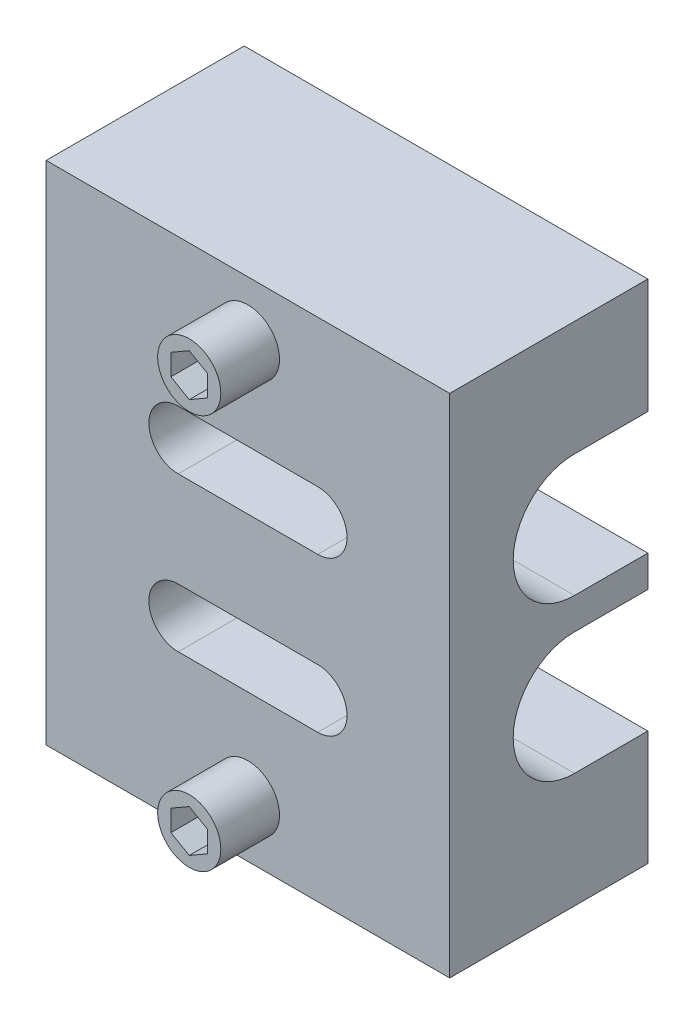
ISO-10303-21;
HEADER;
FILE_DESCRIPTION(('STEP AP214'),'2;1');
FILE_NAME('part.step','',(''),(''),'','','');
FILE_SCHEMA(('AUTOMOTIVE_DESIGN { 1 0 10303 214 1 1 1 1 }'));
ENDSEC;
DATA;
#1=APPLICATION_CONTEXT('core data for automotive mechanical design processes');
#2=APPLICATION_PROTOCOL_DEFINITION('international standard','automotive_design',2000,#1);
#3=PRODUCT_CONTEXT('',#1,'mechanical');
#4=PRODUCT('Part','Part','',(#3));
#5=PRODUCT_RELATED_PRODUCT_CATEGORY('part','',(#4));
#6=PRODUCT_DEFINITION_FORMATION('','',#4);
#7=PRODUCT_DEFINITION_CONTEXT('part definition',#1,'design');
#8=PRODUCT_DEFINITION('design','',#6,#7);
#9=PRODUCT_DEFINITION_SHAPE('','',#8);
#10=(LENGTH_UNIT() NAMED_UNIT(*) SI_UNIT(.MILLI.,.METRE.));
#11=(NAMED_UNIT(*) PLANE_ANGLE_UNIT() SI_UNIT($,.RADIAN.));
#12=(NAMED_UNIT(*) SI_UNIT($,.STERADIAN.) SOLID_ANGLE_UNIT());
#13=UNCERTAINTY_MEASURE_WITH_UNIT(LENGTH_MEASURE(1.E-05),#10,'distance_accuracy_value','');
#14=(GEOMETRIC_REPRESENTATION_CONTEXT(3) GLOBAL_UNCERTAINTY_ASSIGNED_CONTEXT((#13)) GLOBAL_UNIT_ASSIGNED_CONTEXT((#10,
#11,#12)) REPRESENTATION_CONTEXT('',''));
#15=CARTESIAN_POINT('',(0.,0.,0.));
#16=DIRECTION('',(0.,0.,1.));
#17=DIRECTION('',(1.,0.,0.));
#18=AXIS2_PLACEMENT_3D('',#15,#16,#17);
#19=CARTESIAN_POINT('',(-6.985,-8.763,0.));
#20=DIRECTION('',(0.,0.,1.));
#21=DIRECTION('',(1.,0.,0.));
#22=AXIS2_PLACEMENT_3D('',#19,#20,#21);
#23=PLANE('',#22);
#24=DIRECTION('',(0.,1.,0.));
#25=VECTOR('',#24,1.);
#26=CARTESIAN_POINT('',(6.985,-8.763,0.));
#27=LINE('',#26,#25);
#28=CARTESIAN_POINT('',(6.985,-0.546100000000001,0.));
#29=VERTEX_POINT('',#28);
#30=CARTESIAN_POINT('',(6.985,0.546100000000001,0.));
#31=VERTEX_POINT('',#30);
#32=EDGE_CURVE('E342',#29,#31,#27,.T.);
#33=ORIENTED_EDGE('',*,*,#32,.F.);
#34=DIRECTION('',(1.,0.,0.));
#35=VECTOR('',#34,1.);
#36=CARTESIAN_POINT('',(-6.985,-0.546100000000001,0.));
#37=LINE('',#36,#35);
#38=CARTESIAN_POINT('',(-6.985,-0.546100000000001,0.));
#39=VERTEX_POINT('',#38);
#40=EDGE_CURVE('E270',#39,#29,#37,.T.);
#41=ORIENTED_EDGE('',*,*,#40,.F.);
#42=DIRECTION('',(0.,-1.,0.));
#43=VECTOR('',#42,1.);
#44=CARTESIAN_POINT('',(-6.985,8.763,0.));
#45=LINE('',#44,#43);
#46=CARTESIAN_POINT('',(-6.985,0.546100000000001,0.));
#47=VERTEX_POINT('',#46);
#48=EDGE_CURVE('E429',#47,#39,#45,.T.);
#49=ORIENTED_EDGE('',*,*,#48,.F.);
#50=DIRECTION('',(1.,0.,0.));
#51=VECTOR('',#50,1.);
#52=CARTESIAN_POINT('',(-6.985,0.546100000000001,0.));
#53=LINE('',#52,#51);
#54=EDGE_CURVE('E344',#47,#31,#53,.T.);
#55=ORIENTED_EDGE('',*,*,#54,.T.);
#56=EDGE_LOOP('',(#33,#41,#49,#55));
#57=FACE_BOUND('',#56,.T.);
#58=ADVANCED_FACE('F33',(#57),#23,.F.);
#59=CARTESIAN_POINT('',(6.985,4.7879,0.));
#60=VERTEX_POINT('',#59);
#61=CARTESIAN_POINT('',(6.985,8.763,0.));
#62=VERTEX_POINT('',#61);
#63=EDGE_CURVE('E349',#60,#62,#27,.T.);
#64=ORIENTED_EDGE('',*,*,#63,.F.);
#65=DIRECTION('',(1.,0.,0.));
#66=VECTOR('',#65,1.);
#67=CARTESIAN_POINT('',(-6.985,4.7879,0.));
#68=LINE('',#67,#66);
#69=CARTESIAN_POINT('',(-6.985,4.7879,0.));
#70=VERTEX_POINT('',#69);
#71=EDGE_CURVE('E445',#70,#60,#68,.T.);
#72=ORIENTED_EDGE('',*,*,#71,.F.);
#73=CARTESIAN_POINT('',(-6.985,8.763,0.));
#74=VERTEX_POINT('',#73);
#75=EDGE_CURVE('E427',#74,#70,#45,.T.);
#76=ORIENTED_EDGE('',*,*,#75,.F.);
#77=DIRECTION('',(-1.,0.,0.));
#78=VECTOR('',#77,1.);
#79=CARTESIAN_POINT('',(6.985,8.763,0.));
#80=LINE('',#79,#78);
#81=EDGE_CURVE('E352',#62,#74,#80,.T.);
#82=ORIENTED_EDGE('',*,*,#81,.F.);
#83=EDGE_LOOP('',(#64,#72,#76,#82));
#84=FACE_BOUND('',#83,.T.);
#85=ADVANCED_FACE('F315',(#84),#23,.F.);
#86=CARTESIAN_POINT('',(-6.985,-8.763,6.858));
#87=DIRECTION('',(0.,0.,1.));
#88=DIRECTION('',(1.,0.,0.));
#89=AXIS2_PLACEMENT_3D('',#86,#87,#88);
#90=PLANE('',#89);
#91=CARTESIAN_POINT('',(0.,6.8326,6.858));
#92=DIRECTION('',(0.,0.,1.));
#93=DIRECTION('',(1.,0.,0.));
#94=AXIS2_PLACEMENT_3D('',#91,#92,#93);
#95=CIRCLE('',#94,1.0922);
#96=CARTESIAN_POINT('',(1.0922,6.8326,6.858));
#97=VERTEX_POINT('',#96);
#98=EDGE_CURVE('E922',#97,#97,#95,.T.);
#99=ORIENTED_EDGE('',*,*,#98,.F.);
#100=EDGE_LOOP('',(#99));
#101=FACE_BOUND('',#100,.T.);
#102=CARTESIAN_POINT('',(-2.413,2.667,6.858));
#103=DIRECTION('',(0.,0.,1.));
#104=DIRECTION('',(1.,0.,0.));
#105=AXIS2_PLACEMENT_3D('',#102,#103,#104);
#106=CIRCLE('',#105,1.016);
#107=CARTESIAN_POINT('',(-2.413,3.683,6.858));
#108=VERTEX_POINT('',#107);
#109=CARTESIAN_POINT('',(-2.413,1.651,6.858));
#110=VERTEX_POINT('',#109);
#111=EDGE_CURVE('E388',#108,#110,#106,.T.);
#112=ORIENTED_EDGE('',*,*,#111,.F.);
#113=DIRECTION('',(-1.,0.,0.));
#114=VECTOR('',#113,1.);
#115=CARTESIAN_POINT('',(2.413,3.683,6.858));
#116=LINE('',#115,#114);
#117=CARTESIAN_POINT('',(2.413,3.683,6.858));
#118=VERTEX_POINT('',#117);
#119=EDGE_CURVE('E390',#118,#108,#116,.T.);
#120=ORIENTED_EDGE('',*,*,#119,.F.);
#121=CARTESIAN_POINT('',(2.413,2.667,6.858));
#122=DIRECTION('',(0.,0.,1.));
#123=DIRECTION('',(1.,0.,0.));
#124=AXIS2_PLACEMENT_3D('',#121,#122,#123);
#125=CIRCLE('',#124,1.016);
#126=CARTESIAN_POINT('',(2.413,1.651,6.858));
#127=VERTEX_POINT('',#126);
#128=EDGE_CURVE('E395',#127,#118,#125,.T.);
#129=ORIENTED_EDGE('',*,*,#128,.F.);
#130=DIRECTION('',(1.,0.,0.));
#131=VECTOR('',#130,1.);
#132=CARTESIAN_POINT('',(-2.413,1.651,6.858));
#133=LINE('',#132,#131);
#134=EDGE_CURVE('E931',#110,#127,#133,.T.);
#135=ORIENTED_EDGE('',*,*,#134,.F.);
#136=EDGE_LOOP('',(#112,#120,#129,#135));
#137=FACE_BOUND('',#136,.T.);
#138=CARTESIAN_POINT('',(-2.413,-2.667,6.858));
#139=DIRECTION('',(0.,0.,1.));
#140=DIRECTION('',(1.,0.,0.));
#141=AXIS2_PLACEMENT_3D('',#138,#139,#140);
#142=CIRCLE('',#141,1.016);
#143=CARTESIAN_POINT('',(-2.413,-1.651,6.858));
#144=VERTEX_POINT('',#143);
#145=CARTESIAN_POINT('',(-2.413,-3.683,6.858));
#146=VERTEX_POINT('',#145);
#147=EDGE_CURVE('E399',#144,#146,#142,.T.);
#148=ORIENTED_EDGE('',*,*,#147,.F.);
#149=DIRECTION('',(-1.,0.,0.));
#150=VECTOR('',#149,1.);
#151=CARTESIAN_POINT('',(2.413,-1.651,6.858));
#152=LINE('',#151,#150);
#153=CARTESIAN_POINT('',(2.413,-1.651,6.858));
#154=VERTEX_POINT('',#153);
#155=EDGE_CURVE('E409',#154,#144,#152,.T.);
#156=ORIENTED_EDGE('',*,*,#155,.F.);
#157=CARTESIAN_POINT('',(2.413,-2.667,6.858));
#158=DIRECTION('',(0.,0.,1.));
#159=DIRECTION('',(1.,0.,0.));
#160=AXIS2_PLACEMENT_3D('',#157,#158,#159);
#161=CIRCLE('',#160,1.016);
#162=CARTESIAN_POINT('',(2.413,-3.683,6.858));
#163=VERTEX_POINT('',#162);
#164=EDGE_CURVE('E406',#163,#154,#161,.T.);
#165=ORIENTED_EDGE('',*,*,#164,.F.);
#166=DIRECTION('',(1.,0.,0.));
#167=VECTOR('',#166,1.);
#168=CARTESIAN_POINT('',(-2.413,-3.683,6.858));
#169=LINE('',#168,#167);
#170=EDGE_CURVE('E402',#146,#163,#169,.T.);
#171=ORIENTED_EDGE('',*,*,#170,.F.);
#172=EDGE_LOOP('',(#148,#156,#165,#171));
#173=FACE_BOUND('',#172,.T.);
#174=DIRECTION('',(0.,-1.,0.));
#175=VECTOR('',#174,1.);
#176=CARTESIAN_POINT('',(-6.985,8.763,6.858));
#177=LINE('',#176,#175);
#178=CARTESIAN_POINT('',(-6.985,8.763,6.858));
#179=VERTEX_POINT('',#178);
#180=CARTESIAN_POINT('',(-6.985,-8.763,6.858));
#181=VERTEX_POINT('',#180);
#182=EDGE_CURVE('E358',#179,#181,#177,.T.);
#183=ORIENTED_EDGE('',*,*,#182,.T.);
#184=DIRECTION('',(1.,0.,0.));
#185=VECTOR('',#184,1.);
#186=CARTESIAN_POINT('',(-6.985,-8.763,6.858));
#187=LINE('',#186,#185);
#188=CARTESIAN_POINT('',(6.985,-8.763,6.858));
#189=VERTEX_POINT('',#188);
#190=EDGE_CURVE('E423',#181,#189,#187,.T.);
#191=ORIENTED_EDGE('',*,*,#190,.T.);
#192=DIRECTION('',(0.,1.,0.));
#193=VECTOR('',#192,1.);
#194=CARTESIAN_POINT('',(6.985,-8.763,6.858));
#195=LINE('',#194,#193);
#196=CARTESIAN_POINT('',(6.985,8.763,6.858));
#197=VERTEX_POINT('',#196);
#198=EDGE_CURVE('E425',#189,#197,#195,.T.);
#199=ORIENTED_EDGE('',*,*,#198,.T.);
#200=DIRECTION('',(-1.,0.,0.));
#201=VECTOR('',#200,1.);
#202=CARTESIAN_POINT('',(6.985,8.763,6.858));
#203=LINE('',#202,#201);
#204=EDGE_CURVE('E363',#197,#179,#203,.T.);
#205=ORIENTED_EDGE('',*,*,#204,.T.);
#206=EDGE_LOOP('',(#183,#191,#199,#205));
#207=FACE_BOUND('',#206,.T.);
#208=CARTESIAN_POINT('',(0.,-6.8326,6.858));
#209=DIRECTION('',(0.,0.,1.));
#210=DIRECTION('',(1.,0.,0.));
#211=AXIS2_PLACEMENT_3D('',#208,#209,#210);
#212=CIRCLE('',#211,1.0922);
#213=CARTESIAN_POINT('',(1.0922,-6.8326,6.858));
#214=VERTEX_POINT('',#213);
#215=EDGE_CURVE('E908',#214,#214,#212,.T.);
#216=ORIENTED_EDGE('',*,*,#215,.F.);
#217=EDGE_LOOP('',(#216));
#218=FACE_BOUND('',#217,.T.);
#219=ADVANCED_FACE('F312',(#101,#137,#173,#207,#218),#90,.T.);
#220=CARTESIAN_POINT('',(-6.985,8.763,6.858));
#221=DIRECTION('',(1.,0.,0.));
#222=DIRECTION('',(0.,1.,0.));
#223=AXIS2_PLACEMENT_3D('',#220,#221,#222);
#224=PLANE('',#223);
#225=ORIENTED_EDGE('',*,*,#48,.T.);
#226=DIRECTION('',(0.,0.,1.));
#227=VECTOR('',#226,1.);
#228=CARTESIAN_POINT('',(-6.985,-0.546100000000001,0.));
#229=LINE('',#228,#227);
#230=CARTESIAN_POINT('',(-6.985,-0.546100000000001,2.54));
#231=VERTEX_POINT('',#230);
#232=EDGE_CURVE('E250',#39,#231,#229,.T.);
#233=ORIENTED_EDGE('',*,*,#232,.T.);
#234=CARTESIAN_POINT('',(-6.985,-2.667,2.54));
#235=DIRECTION('',(1.,0.,0.));
#236=DIRECTION('',(0.,0.,-1.));
#237=AXIS2_PLACEMENT_3D('',#234,#235,#236);
#238=CIRCLE('',#237,2.1209);
#239=CARTESIAN_POINT('',(-6.985,-4.7879,2.54));
#240=VERTEX_POINT('',#239);
#241=EDGE_CURVE('E245',#231,#240,#238,.T.);
#242=ORIENTED_EDGE('',*,*,#241,.T.);
#243=DIRECTION('',(0.,0.,-1.));
#244=VECTOR('',#243,1.);
#245=CARTESIAN_POINT('',(-6.985,-4.7879,2.54));
#246=LINE('',#245,#244);
#247=CARTESIAN_POINT('',(-6.985,-4.7879,0.));
#248=VERTEX_POINT('',#247);
#249=EDGE_CURVE('E253',#240,#248,#246,.T.);
#250=ORIENTED_EDGE('',*,*,#249,.T.);
#251=CARTESIAN_POINT('',(-6.985,-8.763,0.));
#252=VERTEX_POINT('',#251);
#253=EDGE_CURVE('E415',#248,#252,#45,.T.);
#254=ORIENTED_EDGE('',*,*,#253,.T.);
#255=DIRECTION('',(0.,0.,-1.));
#256=VECTOR('',#255,1.);
#257=CARTESIAN_POINT('',(-6.985,-8.763,6.858));
#258=LINE('',#257,#256);
#259=EDGE_CURVE('E369',#181,#252,#258,.T.);
#260=ORIENTED_EDGE('',*,*,#259,.F.);
#261=ORIENTED_EDGE('',*,*,#182,.F.);
#262=DIRECTION('',(0.,0.,-1.));
#263=VECTOR('',#262,1.);
#264=CARTESIAN_POINT('',(-6.985,8.763,6.858));
#265=LINE('',#264,#263);
#266=EDGE_CURVE('E359',#179,#74,#265,.T.);
#267=ORIENTED_EDGE('',*,*,#266,.T.);
#268=ORIENTED_EDGE('',*,*,#75,.T.);
#269=DIRECTION('',(0.,0.,1.));
#270=VECTOR('',#269,1.);
#271=CARTESIAN_POINT('',(-6.985,4.7879,0.));
#272=LINE('',#271,#270);
#273=CARTESIAN_POINT('',(-6.985,4.7879,2.54));
#274=VERTEX_POINT('',#273);
#275=EDGE_CURVE('E458',#70,#274,#272,.T.);
#276=ORIENTED_EDGE('',*,*,#275,.T.);
#277=CARTESIAN_POINT('',(-6.985,2.667,2.54));
#278=DIRECTION('',(1.,0.,0.));
#279=DIRECTION('',(0.,0.,-1.));
#280=AXIS2_PLACEMENT_3D('',#277,#278,#279);
#281=CIRCLE('',#280,2.1209);
#282=CARTESIAN_POINT('',(-6.985,0.546100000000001,2.54));
#283=VERTEX_POINT('',#282);
#284=EDGE_CURVE('E302',#274,#283,#281,.T.);
#285=ORIENTED_EDGE('',*,*,#284,.T.);
#286=DIRECTION('',(0.,0.,-1.));
#287=VECTOR('',#286,1.);
#288=CARTESIAN_POINT('',(-6.985,0.546100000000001,2.54));
#289=LINE('',#288,#287);
#290=EDGE_CURVE('E828',#283,#47,#289,.T.);
#291=ORIENTED_EDGE('',*,*,#290,.T.);
#292=EDGE_LOOP('',(#225,#233,#242,#250,#254,#260,#261,#267,#268,#276,#285,#291));
#293=FACE_BOUND('',#292,.T.);
#294=ADVANCED_FACE('F35',(#293),#224,.F.);
#295=CARTESIAN_POINT('',(-6.985,-8.763,6.858));
#296=DIRECTION('',(0.,1.,0.));
#297=DIRECTION('',(0.,0.,1.));
#298=AXIS2_PLACEMENT_3D('',#295,#296,#297);
#299=PLANE('',#298);
#300=DIRECTION('',(1.,0.,0.));
#301=VECTOR('',#300,1.);
#302=CARTESIAN_POINT('',(-6.985,-8.763,0.));
#303=LINE('',#302,#301);
#304=CARTESIAN_POINT('',(6.985,-8.763,0.));
#305=VERTEX_POINT('',#304);
#306=EDGE_CURVE('E353',#252,#305,#303,.T.);
#307=ORIENTED_EDGE('',*,*,#306,.T.);
#308=DIRECTION('',(0.,0.,-1.));
#309=VECTOR('',#308,1.);
#310=CARTESIAN_POINT('',(6.985,-8.763,6.858));
#311=LINE('',#310,#309);
#312=EDGE_CURVE('E366',#189,#305,#311,.T.);
#313=ORIENTED_EDGE('',*,*,#312,.F.);
#314=ORIENTED_EDGE('',*,*,#190,.F.);
#315=ORIENTED_EDGE('',*,*,#259,.T.);
#316=EDGE_LOOP('',(#307,#313,#314,#315));
#317=FACE_BOUND('',#316,.T.);
#318=ADVANCED_FACE('F326',(#317),#299,.F.);
#319=CARTESIAN_POINT('',(6.985,-8.763,6.858));
#320=DIRECTION('',(-1.,0.,0.));
#321=DIRECTION('',(0.,0.,1.));
#322=AXIS2_PLACEMENT_3D('',#319,#320,#321);
#323=PLANE('',#322);
#324=CARTESIAN_POINT('',(6.985,-2.667,2.54));
#325=DIRECTION('',(1.,0.,0.));
#326=DIRECTION('',(0.,0.,-1.));
#327=AXIS2_PLACEMENT_3D('',#324,#325,#326);
#328=CIRCLE('',#327,2.1209);
#329=CARTESIAN_POINT('',(6.985,-0.546100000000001,2.54));
#330=VERTEX_POINT('',#329);
#331=CARTESIAN_POINT('',(6.985,-4.7879,2.54));
#332=VERTEX_POINT('',#331);
#333=EDGE_CURVE('E248',#330,#332,#328,.T.);
#334=ORIENTED_EDGE('',*,*,#333,.F.);
#335=DIRECTION('',(0.,0.,1.));
#336=VECTOR('',#335,1.);
#337=CARTESIAN_POINT('',(6.985,-0.546100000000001,0.));
#338=LINE('',#337,#336);
#339=EDGE_CURVE('E259',#29,#330,#338,.T.);
#340=ORIENTED_EDGE('',*,*,#339,.F.);
#341=ORIENTED_EDGE('',*,*,#32,.T.);
#342=DIRECTION('',(0.,0.,-1.));
#343=VECTOR('',#342,1.);
#344=CARTESIAN_POINT('',(6.985,0.546100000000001,2.54));
#345=LINE('',#344,#343);
#346=CARTESIAN_POINT('',(6.985,0.546100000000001,2.54));
#347=VERTEX_POINT('',#346);
#348=EDGE_CURVE('E826',#347,#31,#345,.T.);
#349=ORIENTED_EDGE('',*,*,#348,.F.);
#350=CARTESIAN_POINT('',(6.985,2.667,2.54));
#351=DIRECTION('',(1.,0.,0.));
#352=DIRECTION('',(0.,0.,-1.));
#353=AXIS2_PLACEMENT_3D('',#350,#351,#352);
#354=CIRCLE('',#353,2.1209);
#355=CARTESIAN_POINT('',(6.985,4.7879,2.54));
#356=VERTEX_POINT('',#355);
#357=EDGE_CURVE('E301',#356,#347,#354,.T.);
#358=ORIENTED_EDGE('',*,*,#357,.F.);
#359=DIRECTION('',(0.,0.,1.));
#360=VECTOR('',#359,1.);
#361=CARTESIAN_POINT('',(6.985,4.7879,0.));
#362=LINE('',#361,#360);
#363=EDGE_CURVE('E824',#60,#356,#362,.T.);
#364=ORIENTED_EDGE('',*,*,#363,.F.);
#365=ORIENTED_EDGE('',*,*,#63,.T.);
#366=DIRECTION('',(0.,0.,-1.));
#367=VECTOR('',#366,1.);
#368=CARTESIAN_POINT('',(6.985,8.763,6.858));
#369=LINE('',#368,#367);
#370=EDGE_CURVE('E362',#197,#62,#369,.T.);
#371=ORIENTED_EDGE('',*,*,#370,.F.);
#372=ORIENTED_EDGE('',*,*,#198,.F.);
#373=ORIENTED_EDGE('',*,*,#312,.T.);
#374=CARTESIAN_POINT('',(6.985,-4.7879,0.));
#375=VERTEX_POINT('',#374);
#376=EDGE_CURVE('E348',#305,#375,#27,.T.);
#377=ORIENTED_EDGE('',*,*,#376,.T.);
#378=DIRECTION('',(0.,0.,-1.));
#379=VECTOR('',#378,1.);
#380=CARTESIAN_POINT('',(6.985,-4.7879,2.54));
#381=LINE('',#380,#379);
#382=EDGE_CURVE('E48',#332,#375,#381,.T.);
#383=ORIENTED_EDGE('',*,*,#382,.F.);
#384=EDGE_LOOP('',(#334,#340,#341,#349,#358,#364,#365,#371,#372,#373,#377,#383));
#385=FACE_BOUND('',#384,.T.);
#386=ADVANCED_FACE('F323',(#385),#323,.F.);
#387=CARTESIAN_POINT('',(6.985,8.763,6.858));
#388=DIRECTION('',(0.,-1.,0.));
#389=DIRECTION('',(0.,0.,-1.));
#390=AXIS2_PLACEMENT_3D('',#387,#388,#389);
#391=PLANE('',#390);
#392=ORIENTED_EDGE('',*,*,#81,.T.);
#393=ORIENTED_EDGE('',*,*,#266,.F.);
#394=ORIENTED_EDGE('',*,*,#204,.F.);
#395=ORIENTED_EDGE('',*,*,#370,.T.);
#396=EDGE_LOOP('',(#392,#393,#394,#395));
#397=FACE_BOUND('',#396,.T.);
#398=ADVANCED_FACE('F319',(#397),#391,.F.);
#399=ORIENTED_EDGE('',*,*,#253,.F.);
#400=DIRECTION('',(1.,0.,0.));
#401=VECTOR('',#400,1.);
#402=CARTESIAN_POINT('',(-6.985,-4.7879,0.));
#403=LINE('',#402,#401);
#404=EDGE_CURVE('E249',#248,#375,#403,.T.);
#405=ORIENTED_EDGE('',*,*,#404,.T.);
#406=ORIENTED_EDGE('',*,*,#376,.F.);
#407=ORIENTED_EDGE('',*,*,#306,.F.);
#408=EDGE_LOOP('',(#399,#405,#406,#407));
#409=FACE_BOUND('',#408,.T.);
#410=ADVANCED_FACE('F309',(#409),#23,.F.);
#411=CARTESIAN_POINT('',(-2.413,-2.667,0.));
#412=DIRECTION('',(0.,0.,1.));
#413=DIRECTION('',(1.,0.,0.));
#414=AXIS2_PLACEMENT_3D('',#411,#412,#413);
#415=CYLINDRICAL_SURFACE('',#414,1.016);
#416=DIRECTION('',(0.,0.,1.));
#417=VECTOR('',#416,1.);
#418=CARTESIAN_POINT('',(-2.413,-3.683,0.));
#419=LINE('',#418,#417);
#420=CARTESIAN_POINT('',(-2.413,-3.683,4.40170910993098));
#421=VERTEX_POINT('',#420);
#422=EDGE_CURVE('E412',#421,#146,#419,.T.);
#423=ORIENTED_EDGE('',*,*,#422,.F.);
#424=CARTESIAN_POINT('',(-2.413,-3.683,4.40170910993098));
#425=CARTESIAN_POINT('',(-2.43978234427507,-3.68300179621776,4.40170423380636));
#426=CARTESIAN_POINT('',(-2.46654974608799,-3.68194031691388,4.40228775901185));
#427=CARTESIAN_POINT('',(-2.51985515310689,-3.6777186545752,4.40458398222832));
#428=CARTESIAN_POINT('',(-2.54639327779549,-3.67455964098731,4.4062960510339));
#429=CARTESIAN_POINT('',(-2.62508427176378,-3.66202804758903,4.41302688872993));
#430=CARTESIAN_POINT('',(-2.67664897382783,-3.64960010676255,4.41964147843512));
#431=CARTESIAN_POINT('',(-2.77659374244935,-3.61716748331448,4.43623943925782));
#432=CARTESIAN_POINT('',(-2.82497933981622,-3.59717639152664,4.44621676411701));
#433=CARTESIAN_POINT('',(-2.91777905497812,-3.55026730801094,4.46840045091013));
#434=CARTESIAN_POINT('',(-2.96218743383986,-3.52333951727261,4.48060995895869));
#435=CARTESIAN_POINT('',(-3.049353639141,-3.46097298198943,4.5069905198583));
#436=CARTESIAN_POINT('',(-3.09174024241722,-3.42504866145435,4.52123997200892));
#437=CARTESIAN_POINT('',(-3.17016585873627,-3.34672658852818,4.54945790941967));
#438=CARTESIAN_POINT('',(-3.20620325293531,-3.3043271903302,4.56342632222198));
#439=CARTESIAN_POINT('',(-3.2730540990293,-3.21110214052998,4.59052749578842));
#440=CARTESIAN_POINT('',(-3.30341727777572,-3.15992109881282,4.60355796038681));
#441=CARTESIAN_POINT('',(-3.35493399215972,-3.05243693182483,4.62630401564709));
#442=CARTESIAN_POINT('',(-3.37609284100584,-2.99613678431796,4.63602151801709));
#443=CARTESIAN_POINT('',(-3.40715331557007,-2.88396520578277,4.65047997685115));
#444=CARTESIAN_POINT('',(-3.4177076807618,-2.82831232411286,4.6555078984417));
#445=CARTESIAN_POINT('',(-3.42939865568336,-2.71581425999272,4.66108437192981));
#446=CARTESIAN_POINT('',(-3.43054027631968,-2.65896972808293,4.66163530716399));
#447=CARTESIAN_POINT('',(-3.42364916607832,-2.55056567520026,4.65834053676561));
#448=CARTESIAN_POINT('',(-3.41634291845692,-2.49894709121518,4.65484296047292));
#449=CARTESIAN_POINT('',(-3.39404904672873,-2.39777436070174,4.64435775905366));
#450=CARTESIAN_POINT('',(-3.3790609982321,-2.34822032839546,4.63736994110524));
#451=CARTESIAN_POINT('',(-3.34170273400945,-2.25168498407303,4.62042526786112));
#452=CARTESIAN_POINT('',(-3.31922792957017,-2.20475179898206,4.61042655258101));
#453=CARTESIAN_POINT('',(-3.26766304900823,-2.11520334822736,4.58838156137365));
#454=CARTESIAN_POINT('',(-3.2385704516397,-2.07258973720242,4.57633450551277));
#455=CARTESIAN_POINT('',(-3.17162775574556,-1.9888692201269,4.55008617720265));
#456=CARTESIAN_POINT('',(-3.13323036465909,-1.94822970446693,4.53578861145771));
#457=CARTESIAN_POINT('',(-3.05024244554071,-1.87372149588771,4.50736362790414));
#458=CARTESIAN_POINT('',(-3.00564713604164,-1.83985808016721,4.49323635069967));
#459=CARTESIAN_POINT('',(-2.90851063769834,-1.77805736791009,4.46592909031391));
#460=CARTESIAN_POINT('',(-2.8556667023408,-1.75055043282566,4.45284445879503));
#461=CARTESIAN_POINT('',(-2.74535767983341,-1.70505629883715,4.43037863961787));
#462=CARTESIAN_POINT('',(-2.68790320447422,-1.68704792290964,4.42098922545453));
#463=CARTESIAN_POINT('',(-2.59375833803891,-1.66655483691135,4.4101342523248));
#464=CARTESIAN_POINT('',(-2.55795596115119,-1.66074195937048,4.40700144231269));
#465=CARTESIAN_POINT('',(-2.48578028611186,-1.6529573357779,4.40277767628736));
#466=CARTESIAN_POINT('',(-2.44940641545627,-1.65098972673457,4.40168891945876));
#467=CARTESIAN_POINT('',(-2.413,-1.651,4.40170910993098));
#468=B_SPLINE_CURVE_WITH_KNOTS('',3,(#424,#425,#426,#427,#428,#429,#430,#431,#432,#433,#434,
#435,#436,#437,#438,#439,#440,#441,#442,#443,#444,#445,#446,#447,#448,#449,#450,#451,#452,#453,
#454,#455,#456,#457,#458,#459,#460,#461,#462,#463,#464,#465,#466,#467),.UNSPECIFIED.,.F.,.F.,(4,
2,2,2,2,2,2,2,2,2,2,2,2,2,2,2,2,2,2,2,2,4),(0.,0.0802911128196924,0.160537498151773,
0.320038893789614,0.479255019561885,0.638697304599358,0.810052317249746,0.981450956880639,
1.16326064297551,1.3449652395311,1.51463586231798,1.68421615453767,1.84023301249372,
1.99625849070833,2.15456202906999,2.31292597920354,2.48531015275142,2.65782806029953,
2.83986996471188,3.02150427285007,3.13047814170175,3.23956918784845),.UNSPECIFIED.);
#469=CARTESIAN_POINT('',(-2.413,-1.651,4.40170910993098));
#470=VERTEX_POINT('',#469);
#471=EDGE_CURVE('E56',#421,#470,#468,.T.);
#472=ORIENTED_EDGE('',*,*,#471,.T.);
#473=DIRECTION('',(0.,0.,1.));
#474=VECTOR('',#473,1.);
#475=CARTESIAN_POINT('',(-2.413,-1.651,0.));
#476=LINE('',#475,#474);
#477=EDGE_CURVE('E413',#470,#144,#476,.T.);
#478=ORIENTED_EDGE('',*,*,#477,.T.);
#479=ORIENTED_EDGE('',*,*,#147,.T.);
#480=EDGE_LOOP('',(#423,#472,#478,#479));
#481=FACE_BOUND('',#480,.T.);
#482=ADVANCED_FACE('F304',(#481),#415,.F.);
#483=CARTESIAN_POINT('',(2.413,-1.651,0.));
#484=DIRECTION('',(0.,1.,0.));
#485=DIRECTION('',(0.,0.,1.));
#486=AXIS2_PLACEMENT_3D('',#483,#484,#485);
#487=PLANE('',#486);
#488=ORIENTED_EDGE('',*,*,#477,.F.);
#489=DIRECTION('',(1.,0.,0.));
#490=VECTOR('',#489,1.);
#491=CARTESIAN_POINT('',(-6.985,-1.651,4.40170910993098));
#492=LINE('',#491,#490);
#493=CARTESIAN_POINT('',(2.413,-1.651,4.40170910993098));
#494=VERTEX_POINT('',#493);
#495=EDGE_CURVE('E280',#470,#494,#492,.T.);
#496=ORIENTED_EDGE('',*,*,#495,.T.);
#497=DIRECTION('',(0.,0.,1.));
#498=VECTOR('',#497,1.);
#499=CARTESIAN_POINT('',(2.413,-1.651,0.));
#500=LINE('',#499,#498);
#501=EDGE_CURVE('E416',#494,#154,#500,.T.);
#502=ORIENTED_EDGE('',*,*,#501,.T.);
#503=ORIENTED_EDGE('',*,*,#155,.T.);
#504=EDGE_LOOP('',(#488,#496,#502,#503));
#505=FACE_BOUND('',#504,.T.);
#506=ADVANCED_FACE('F308',(#505),#487,.F.);
#507=CARTESIAN_POINT('',(2.413,-2.667,0.));
#508=DIRECTION('',(0.,0.,1.));
#509=DIRECTION('',(1.,0.,0.));
#510=AXIS2_PLACEMENT_3D('',#507,#508,#509);
#511=CYLINDRICAL_SURFACE('',#510,1.016);
#512=ORIENTED_EDGE('',*,*,#501,.F.);
#513=CARTESIAN_POINT('',(2.413,-1.651,4.40170910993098));
#514=CARTESIAN_POINT('',(2.43978234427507,-1.65099820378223,4.40170423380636));
#515=CARTESIAN_POINT('',(2.46654974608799,-1.65205968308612,4.40228775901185));
#516=CARTESIAN_POINT('',(2.51985515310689,-1.65628134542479,4.40458398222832));
#517=CARTESIAN_POINT('',(2.54639327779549,-1.65944035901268,4.4062960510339));
#518=CARTESIAN_POINT('',(2.62508427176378,-1.67197195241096,4.41302688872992));
#519=CARTESIAN_POINT('',(2.67664897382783,-1.68439989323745,4.41964147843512));
#520=CARTESIAN_POINT('',(2.77659374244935,-1.71683251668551,4.43623943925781));
#521=CARTESIAN_POINT('',(2.82497933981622,-1.73682360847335,4.446216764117));
#522=CARTESIAN_POINT('',(2.91777905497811,-1.78373269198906,4.46840045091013));
#523=CARTESIAN_POINT('',(2.96218743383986,-1.81066048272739,4.48060995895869));
#524=CARTESIAN_POINT('',(3.049353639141,-1.87302701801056,4.5069905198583));
#525=CARTESIAN_POINT('',(3.09174024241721,-1.90895133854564,4.52123997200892));
#526=CARTESIAN_POINT('',(3.17016585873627,-1.98727341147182,4.54945790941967));
#527=CARTESIAN_POINT('',(3.20620325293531,-2.02967280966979,4.56342632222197));
#528=CARTESIAN_POINT('',(3.2730540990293,-2.12289785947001,4.59052749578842));
#529=CARTESIAN_POINT('',(3.30341727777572,-2.17407890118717,4.60355796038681));
#530=CARTESIAN_POINT('',(3.35493399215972,-2.28156306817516,4.62630401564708));
#531=CARTESIAN_POINT('',(3.37609284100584,-2.33786321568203,4.63602151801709));
#532=CARTESIAN_POINT('',(3.40715331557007,-2.45003479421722,4.65047997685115));
#533=CARTESIAN_POINT('',(3.4177076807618,-2.50568767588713,4.6555078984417));
#534=CARTESIAN_POINT('',(3.42939865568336,-2.61818574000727,4.66108437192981));
#535=CARTESIAN_POINT('',(3.43054027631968,-2.67503027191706,4.66163530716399));
#536=CARTESIAN_POINT('',(3.42364916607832,-2.78343432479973,4.65834053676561));
#537=CARTESIAN_POINT('',(3.41634291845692,-2.83505290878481,4.65484296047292));
#538=CARTESIAN_POINT('',(3.39404904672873,-2.93622563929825,4.64435775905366));
#539=CARTESIAN_POINT('',(3.3790609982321,-2.98577967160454,4.63736994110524));
#540=CARTESIAN_POINT('',(3.34170273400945,-3.08231501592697,4.62042526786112));
#541=CARTESIAN_POINT('',(3.31922792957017,-3.12924820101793,4.61042655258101));
#542=CARTESIAN_POINT('',(3.26766304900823,-3.21879665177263,4.58838156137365));
#543=CARTESIAN_POINT('',(3.2385704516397,-3.26141026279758,4.57633450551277));
#544=CARTESIAN_POINT('',(3.17162775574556,-3.34513077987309,4.55008617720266));
#545=CARTESIAN_POINT('',(3.13323036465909,-3.38577029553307,4.53578861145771));
#546=CARTESIAN_POINT('',(3.05024244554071,-3.46027850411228,4.50736362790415));
#547=CARTESIAN_POINT('',(3.00564713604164,-3.49414191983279,4.49323635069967));
#548=CARTESIAN_POINT('',(2.90851063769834,-3.55594263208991,4.46592909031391));
#549=CARTESIAN_POINT('',(2.8556667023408,-3.58344956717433,4.45284445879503));
#550=CARTESIAN_POINT('',(2.74535767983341,-3.62894370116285,4.43037863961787));
#551=CARTESIAN_POINT('',(2.68790320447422,-3.64695207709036,4.42098922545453));
#552=CARTESIAN_POINT('',(2.59375833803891,-3.66744516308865,4.4101342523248));
#553=CARTESIAN_POINT('',(2.55795596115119,-3.67325804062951,4.40700144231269));
#554=CARTESIAN_POINT('',(2.48578028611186,-3.6810426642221,4.40277767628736));
#555=CARTESIAN_POINT('',(2.44940641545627,-3.68301027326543,4.40168891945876));
#556=CARTESIAN_POINT('',(2.413,-3.683,4.40170910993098));
#557=B_SPLINE_CURVE_WITH_KNOTS('',3,(#513,#514,#515,#516,#517,#518,#519,#520,#521,#522,#523,
#524,#525,#526,#527,#528,#529,#530,#531,#532,#533,#534,#535,#536,#537,#538,#539,#540,#541,#542,
#543,#544,#545,#546,#547,#548,#549,#550,#551,#552,#553,#554,#555,#556),.UNSPECIFIED.,.F.,.F.,(4,
2,2,2,2,2,2,2,2,2,2,2,2,2,2,2,2,2,2,2,2,4),(0.,0.0802911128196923,0.160537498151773,
0.320038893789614,0.479255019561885,0.638697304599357,0.810052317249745,0.981450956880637,
1.16326064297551,1.3449652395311,1.51463586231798,1.68421615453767,1.84023301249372,
1.99625849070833,2.15456202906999,2.31292597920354,2.48531015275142,2.65782806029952,
2.83986996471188,3.02150427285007,3.13047814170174,3.23956918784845),.UNSPECIFIED.);
#558=CARTESIAN_POINT('',(2.413,-3.683,4.40170910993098));
#559=VERTEX_POINT('',#558);
#560=EDGE_CURVE('E269',#494,#559,#557,.T.);
#561=ORIENTED_EDGE('',*,*,#560,.T.);
#562=DIRECTION('',(0.,0.,1.));
#563=VECTOR('',#562,1.);
#564=CARTESIAN_POINT('',(2.413,-3.683,0.));
#565=LINE('',#564,#563);
#566=EDGE_CURVE('E418',#559,#163,#565,.T.);
#567=ORIENTED_EDGE('',*,*,#566,.T.);
#568=ORIENTED_EDGE('',*,*,#164,.T.);
#569=EDGE_LOOP('',(#512,#561,#567,#568));
#570=FACE_BOUND('',#569,.T.);
#571=ADVANCED_FACE('F282',(#570),#511,.F.);
#572=CARTESIAN_POINT('',(-2.413,-3.683,0.));
#573=DIRECTION('',(0.,-1.,0.));
#574=DIRECTION('',(0.,0.,-1.));
#575=AXIS2_PLACEMENT_3D('',#572,#573,#574);
#576=PLANE('',#575);
#577=ORIENTED_EDGE('',*,*,#566,.F.);
#578=DIRECTION('',(1.,0.,0.));
#579=VECTOR('',#578,1.);
#580=CARTESIAN_POINT('',(-6.985,-3.683,4.40170910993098));
#581=LINE('',#580,#579);
#582=EDGE_CURVE('E11',#559,#421,#581,.F.);
#583=ORIENTED_EDGE('',*,*,#582,.T.);
#584=ORIENTED_EDGE('',*,*,#422,.T.);
#585=ORIENTED_EDGE('',*,*,#170,.T.);
#586=EDGE_LOOP('',(#577,#583,#584,#585));
#587=FACE_BOUND('',#586,.T.);
#588=ADVANCED_FACE('F311',(#587),#576,.F.);
#589=CARTESIAN_POINT('',(-2.413,2.667,0.));
#590=DIRECTION('',(0.,0.,1.));
#591=DIRECTION('',(1.,0.,0.));
#592=AXIS2_PLACEMENT_3D('',#589,#590,#591);
#593=CYLINDRICAL_SURFACE('',#592,1.016);
#594=DIRECTION('',(0.,0.,1.));
#595=VECTOR('',#594,1.);
#596=CARTESIAN_POINT('',(-2.413,1.651,0.));
#597=LINE('',#596,#595);
#598=CARTESIAN_POINT('',(-2.413,1.651,4.40170910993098));
#599=VERTEX_POINT('',#598);
#600=EDGE_CURVE('E377',#599,#110,#597,.T.);
#601=ORIENTED_EDGE('',*,*,#600,.F.);
#602=CARTESIAN_POINT('',(-2.413,1.651,4.40170910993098));
#603=CARTESIAN_POINT('',(-2.43978234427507,1.65099820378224,4.40170423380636));
#604=CARTESIAN_POINT('',(-2.46654974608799,1.65205968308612,4.40228775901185));
#605=CARTESIAN_POINT('',(-2.51985515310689,1.6562813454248,4.40458398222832));
#606=CARTESIAN_POINT('',(-2.54639327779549,1.65944035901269,4.4062960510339));
#607=CARTESIAN_POINT('',(-2.62508427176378,1.67197195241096,4.41302688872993));
#608=CARTESIAN_POINT('',(-2.67664897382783,1.68439989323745,4.41964147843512));
#609=CARTESIAN_POINT('',(-2.77659374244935,1.71683251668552,4.43623943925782));
#610=CARTESIAN_POINT('',(-2.82497933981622,1.73682360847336,4.44621676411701));
#611=CARTESIAN_POINT('',(-2.91777905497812,1.78373269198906,4.46840045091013));
#612=CARTESIAN_POINT('',(-2.96218743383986,1.81066048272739,4.48060995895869));
#613=CARTESIAN_POINT('',(-3.049353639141,1.87302701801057,4.5069905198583));
#614=CARTESIAN_POINT('',(-3.09174024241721,1.90895133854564,4.52123997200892));
#615=CARTESIAN_POINT('',(-3.17016585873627,1.98727341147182,4.54945790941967));
#616=CARTESIAN_POINT('',(-3.20620325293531,2.0296728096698,4.56342632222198));
#617=CARTESIAN_POINT('',(-3.2730540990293,2.12289785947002,4.59052749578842));
#618=CARTESIAN_POINT('',(-3.30341727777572,2.17407890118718,4.60355796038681));
#619=CARTESIAN_POINT('',(-3.35493399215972,2.28156306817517,4.62630401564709));
#620=CARTESIAN_POINT('',(-3.37609284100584,2.33786321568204,4.63602151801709));
#621=CARTESIAN_POINT('',(-3.40715331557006,2.45003479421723,4.65047997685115));
#622=CARTESIAN_POINT('',(-3.4177076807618,2.50568767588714,4.6555078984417));
#623=CARTESIAN_POINT('',(-3.42939865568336,2.61818574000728,4.66108437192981));
#624=CARTESIAN_POINT('',(-3.43054027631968,2.67503027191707,4.66163530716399));
#625=CARTESIAN_POINT('',(-3.42364916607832,2.78343432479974,4.65834053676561));
#626=CARTESIAN_POINT('',(-3.41634291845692,2.83505290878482,4.65484296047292));
#627=CARTESIAN_POINT('',(-3.39404904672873,2.93622563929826,4.64435775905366));
#628=CARTESIAN_POINT('',(-3.3790609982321,2.98577967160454,4.63736994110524));
#629=CARTESIAN_POINT('',(-3.34170273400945,3.08231501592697,4.62042526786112));
#630=CARTESIAN_POINT('',(-3.31922792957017,3.12924820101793,4.61042655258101));
#631=CARTESIAN_POINT('',(-3.26766304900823,3.21879665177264,4.58838156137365));
#632=CARTESIAN_POINT('',(-3.2385704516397,3.26141026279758,4.57633450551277));
#633=CARTESIAN_POINT('',(-3.17162775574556,3.3451307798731,4.55008617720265));
#634=CARTESIAN_POINT('',(-3.13323036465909,3.38577029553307,4.53578861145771));
#635=CARTESIAN_POINT('',(-3.05024244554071,3.46027850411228,4.50736362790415));
#636=CARTESIAN_POINT('',(-3.00564713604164,3.49414191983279,4.49323635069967));
#637=CARTESIAN_POINT('',(-2.90851063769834,3.55594263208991,4.46592909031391));
#638=CARTESIAN_POINT('',(-2.8556667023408,3.58344956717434,4.45284445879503));
#639=CARTESIAN_POINT('',(-2.74535767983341,3.62894370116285,4.43037863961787));
#640=CARTESIAN_POINT('',(-2.68790320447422,3.64695207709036,4.42098922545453));
#641=CARTESIAN_POINT('',(-2.59375833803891,3.66744516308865,4.4101342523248));
#642=CARTESIAN_POINT('',(-2.55795596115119,3.67325804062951,4.40700144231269));
#643=CARTESIAN_POINT('',(-2.48578028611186,3.6810426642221,4.40277767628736));
#644=CARTESIAN_POINT('',(-2.44940641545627,3.68301027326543,4.40168891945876));
#645=CARTESIAN_POINT('',(-2.413,3.683,4.40170910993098));
#646=B_SPLINE_CURVE_WITH_KNOTS('',3,(#602,#603,#604,#605,#606,#607,#608,#609,#610,#611,#612,
#613,#614,#615,#616,#617,#618,#619,#620,#621,#622,#623,#624,#625,#626,#627,#628,#629,#630,#631,
#632,#633,#634,#635,#636,#637,#638,#639,#640,#641,#642,#643,#644,#645),.UNSPECIFIED.,.F.,.F.,(4,
2,2,2,2,2,2,2,2,2,2,2,2,2,2,2,2,2,2,2,2,4),(0.,0.0802911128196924,0.160537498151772,
0.320038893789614,0.479255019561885,0.638697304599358,0.810052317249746,0.981450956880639,
1.16326064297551,1.3449652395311,1.51463586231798,1.68421615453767,1.84023301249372,
1.99625849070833,2.15456202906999,2.31292597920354,2.48531015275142,2.65782806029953,
2.83986996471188,3.02150427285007,3.13047814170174,3.23956918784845),.UNSPECIFIED.);
#647=CARTESIAN_POINT('',(-2.413,3.683,4.40170910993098));
#648=VERTEX_POINT('',#647);
#649=EDGE_CURVE('E385',#599,#648,#646,.T.);
#650=ORIENTED_EDGE('',*,*,#649,.T.);
#651=DIRECTION('',(0.,0.,1.));
#652=VECTOR('',#651,1.);
#653=CARTESIAN_POINT('',(-2.413,3.683,0.));
#654=LINE('',#653,#652);
#655=EDGE_CURVE('E403',#648,#108,#654,.T.);
#656=ORIENTED_EDGE('',*,*,#655,.T.);
#657=ORIENTED_EDGE('',*,*,#111,.T.);
#658=EDGE_LOOP('',(#601,#650,#656,#657));
#659=FACE_BOUND('',#658,.T.);
#660=ADVANCED_FACE('F384',(#659),#593,.F.);
#661=CARTESIAN_POINT('',(2.413,3.683,0.));
#662=DIRECTION('',(0.,1.,0.));
#663=DIRECTION('',(0.,0.,1.));
#664=AXIS2_PLACEMENT_3D('',#661,#662,#663);
#665=PLANE('',#664);
#666=ORIENTED_EDGE('',*,*,#655,.F.);
#667=DIRECTION('',(1.,0.,0.));
#668=VECTOR('',#667,1.);
#669=CARTESIAN_POINT('',(-6.985,3.683,4.40170910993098));
#670=LINE('',#669,#668);
#671=CARTESIAN_POINT('',(2.413,3.683,4.40170910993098));
#672=VERTEX_POINT('',#671);
#673=EDGE_CURVE('E465',#648,#672,#670,.T.);
#674=ORIENTED_EDGE('',*,*,#673,.T.);
#675=DIRECTION('',(0.,0.,1.));
#676=VECTOR('',#675,1.);
#677=CARTESIAN_POINT('',(2.413,3.683,0.));
#678=LINE('',#677,#676);
#679=EDGE_CURVE('E392',#672,#118,#678,.T.);
#680=ORIENTED_EDGE('',*,*,#679,.T.);
#681=ORIENTED_EDGE('',*,*,#119,.T.);
#682=EDGE_LOOP('',(#666,#674,#680,#681));
#683=FACE_BOUND('',#682,.T.);
#684=ADVANCED_FACE('F489',(#683),#665,.F.);
#685=CARTESIAN_POINT('',(2.413,2.667,0.));
#686=DIRECTION('',(0.,0.,1.));
#687=DIRECTION('',(1.,0.,0.));
#688=AXIS2_PLACEMENT_3D('',#685,#686,#687);
#689=CYLINDRICAL_SURFACE('',#688,1.016);
#690=ORIENTED_EDGE('',*,*,#679,.F.);
#691=CARTESIAN_POINT('',(2.413,3.683,4.40170910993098));
#692=CARTESIAN_POINT('',(2.43978234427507,3.68300179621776,4.40170423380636));
#693=CARTESIAN_POINT('',(2.46654974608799,3.68194031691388,4.40228775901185));
#694=CARTESIAN_POINT('',(2.51985515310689,3.67771865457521,4.40458398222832));
#695=CARTESIAN_POINT('',(2.54639327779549,3.67455964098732,4.4062960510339));
#696=CARTESIAN_POINT('',(2.62508427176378,3.66202804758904,4.41302688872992));
#697=CARTESIAN_POINT('',(2.67664897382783,3.64960010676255,4.41964147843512));
#698=CARTESIAN_POINT('',(2.77659374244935,3.61716748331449,4.43623943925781));
#699=CARTESIAN_POINT('',(2.82497933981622,3.59717639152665,4.446216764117));
#700=CARTESIAN_POINT('',(2.91777905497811,3.55026730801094,4.46840045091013));
#701=CARTESIAN_POINT('',(2.96218743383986,3.52333951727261,4.48060995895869));
#702=CARTESIAN_POINT('',(3.049353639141,3.46097298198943,4.5069905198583));
#703=CARTESIAN_POINT('',(3.09174024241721,3.42504866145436,4.52123997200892));
#704=CARTESIAN_POINT('',(3.17016585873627,3.34672658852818,4.54945790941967));
#705=CARTESIAN_POINT('',(3.20620325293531,3.3043271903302,4.56342632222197));
#706=CARTESIAN_POINT('',(3.2730540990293,3.21110214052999,4.59052749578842));
#707=CARTESIAN_POINT('',(3.30341727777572,3.15992109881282,4.60355796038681));
#708=CARTESIAN_POINT('',(3.35493399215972,3.05243693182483,4.62630401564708));
#709=CARTESIAN_POINT('',(3.37609284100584,2.99613678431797,4.63602151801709));
#710=CARTESIAN_POINT('',(3.40715331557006,2.88396520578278,4.65047997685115));
#711=CARTESIAN_POINT('',(3.4177076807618,2.82831232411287,4.6555078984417));
#712=CARTESIAN_POINT('',(3.42939865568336,2.71581425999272,4.66108437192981));
#713=CARTESIAN_POINT('',(3.43054027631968,2.65896972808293,4.66163530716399));
#714=CARTESIAN_POINT('',(3.42364916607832,2.55056567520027,4.65834053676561));
#715=CARTESIAN_POINT('',(3.41634291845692,2.49894709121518,4.65484296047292));
#716=CARTESIAN_POINT('',(3.39404904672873,2.39777436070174,4.64435775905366));
#717=CARTESIAN_POINT('',(3.3790609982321,2.34822032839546,4.63736994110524));
#718=CARTESIAN_POINT('',(3.34170273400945,2.25168498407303,4.62042526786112));
#719=CARTESIAN_POINT('',(3.31922792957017,2.20475179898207,4.61042655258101));
#720=CARTESIAN_POINT('',(3.26766304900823,2.11520334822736,4.58838156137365));
#721=CARTESIAN_POINT('',(3.2385704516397,2.07258973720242,4.57633450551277));
#722=CARTESIAN_POINT('',(3.17162775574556,1.98886922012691,4.55008617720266));
#723=CARTESIAN_POINT('',(3.13323036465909,1.94822970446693,4.53578861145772));
#724=CARTESIAN_POINT('',(3.05024244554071,1.87372149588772,4.50736362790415));
#725=CARTESIAN_POINT('',(3.00564713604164,1.83985808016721,4.49323635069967));
#726=CARTESIAN_POINT('',(2.90851063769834,1.77805736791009,4.46592909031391));
#727=CARTESIAN_POINT('',(2.8556667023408,1.75055043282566,4.45284445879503));
#728=CARTESIAN_POINT('',(2.74535767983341,1.70505629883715,4.43037863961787));
#729=CARTESIAN_POINT('',(2.68790320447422,1.68704792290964,4.42098922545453));
#730=CARTESIAN_POINT('',(2.59375833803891,1.66655483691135,4.4101342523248));
#731=CARTESIAN_POINT('',(2.55795596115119,1.66074195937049,4.40700144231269));
#732=CARTESIAN_POINT('',(2.48578028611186,1.6529573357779,4.40277767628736));
#733=CARTESIAN_POINT('',(2.44940641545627,1.65098972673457,4.40168891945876));
#734=CARTESIAN_POINT('',(2.413,1.651,4.40170910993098));
#735=B_SPLINE_CURVE_WITH_KNOTS('',3,(#691,#692,#693,#694,#695,#696,#697,#698,#699,#700,#701,
#702,#703,#704,#705,#706,#707,#708,#709,#710,#711,#712,#713,#714,#715,#716,#717,#718,#719,#720,
#721,#722,#723,#724,#725,#726,#727,#728,#729,#730,#731,#732,#733,#734),.UNSPECIFIED.,.F.,.F.,(4,
2,2,2,2,2,2,2,2,2,2,2,2,2,2,2,2,2,2,2,2,4),(0.,0.0802911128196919,0.160537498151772,
0.320038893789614,0.479255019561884,0.638697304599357,0.810052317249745,0.981450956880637,
1.16326064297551,1.3449652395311,1.51463586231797,1.68421615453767,1.84023301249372,
1.99625849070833,2.15456202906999,2.31292597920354,2.48531015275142,2.65782806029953,
2.83986996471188,3.02150427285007,3.13047814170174,3.23956918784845),.UNSPECIFIED.);
#736=CARTESIAN_POINT('',(2.413,1.651,4.40170910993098));
#737=VERTEX_POINT('',#736);
#738=EDGE_CURVE('E451',#672,#737,#735,.T.);
#739=ORIENTED_EDGE('',*,*,#738,.T.);
#740=DIRECTION('',(0.,0.,1.));
#741=VECTOR('',#740,1.);
#742=CARTESIAN_POINT('',(2.413,1.651,0.));
#743=LINE('',#742,#741);
#744=EDGE_CURVE('E379',#737,#127,#743,.T.);
#745=ORIENTED_EDGE('',*,*,#744,.T.);
#746=ORIENTED_EDGE('',*,*,#128,.T.);
#747=EDGE_LOOP('',(#690,#739,#745,#746));
#748=FACE_BOUND('',#747,.T.);
#749=ADVANCED_FACE('F467',(#748),#689,.F.);
#750=CARTESIAN_POINT('',(-2.413,1.651,0.));
#751=DIRECTION('',(0.,-1.,0.));
#752=DIRECTION('',(0.,0.,-1.));
#753=AXIS2_PLACEMENT_3D('',#750,#751,#752);
#754=PLANE('',#753);
#755=ORIENTED_EDGE('',*,*,#744,.F.);
#756=DIRECTION('',(1.,0.,0.));
#757=VECTOR('',#756,1.);
#758=CARTESIAN_POINT('',(-6.985,1.651,4.40170910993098));
#759=LINE('',#758,#757);
#760=EDGE_CURVE('E41',#737,#599,#759,.F.);
#761=ORIENTED_EDGE('',*,*,#760,.T.);
#762=ORIENTED_EDGE('',*,*,#600,.T.);
#763=ORIENTED_EDGE('',*,*,#134,.T.);
#764=EDGE_LOOP('',(#755,#761,#762,#763));
#765=FACE_BOUND('',#764,.T.);
#766=ADVANCED_FACE('F375',(#765),#754,.F.);
#767=CARTESIAN_POINT('',(0.,6.8326,8.89));
#768=DIRECTION('',(0.,0.,-1.));
#769=DIRECTION('',(-1.,0.,0.));
#770=AXIS2_PLACEMENT_3D('',#767,#768,#769);
#771=CYLINDRICAL_SURFACE('',#770,1.0922);
#772=CARTESIAN_POINT('',(0.,6.8326,8.89));
#773=DIRECTION('',(0.,0.,1.));
#774=DIRECTION('',(1.,0.,0.));
#775=AXIS2_PLACEMENT_3D('',#772,#773,#774);
#776=CIRCLE('',#775,1.0922);
#777=CARTESIAN_POINT('',(1.0922,6.8326,8.89));
#778=VERTEX_POINT('',#777);
#779=EDGE_CURVE('E925',#778,#778,#776,.T.);
#780=ORIENTED_EDGE('',*,*,#779,.F.);
#781=EDGE_LOOP('',(#780));
#782=FACE_BOUND('',#781,.T.);
#783=ORIENTED_EDGE('',*,*,#98,.T.);
#784=EDGE_LOOP('',(#783));
#785=FACE_BOUND('',#784,.T.);
#786=ADVANCED_FACE('F534',(#782,#785),#771,.T.);
#787=CARTESIAN_POINT('',(0.,6.8326,8.89));
#788=DIRECTION('',(0.,0.,1.));
#789=DIRECTION('',(1.,0.,0.));
#790=AXIS2_PLACEMENT_3D('',#787,#788,#789);
#791=PLANE('',#790);
#792=DIRECTION('',(-0.866025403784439,0.499999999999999,0.));
#793=VECTOR('',#792,1.);
#794=CARTESIAN_POINT('',(0.635,7.19921742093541,8.89));
#795=LINE('',#794,#793);
#796=CARTESIAN_POINT('',(0.635,7.19921742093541,8.89));
#797=VERTEX_POINT('',#796);
#798=CARTESIAN_POINT('',(0.,7.56583484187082,8.89));
#799=VERTEX_POINT('',#798);
#800=EDGE_CURVE('E859',#797,#799,#795,.T.);
#801=ORIENTED_EDGE('',*,*,#800,.F.);
#802=DIRECTION('',(0.,1.,0.));
#803=VECTOR('',#802,1.);
#804=CARTESIAN_POINT('',(0.635,6.46598257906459,8.89));
#805=LINE('',#804,#803);
#806=CARTESIAN_POINT('',(0.635,6.46598257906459,8.89));
#807=VERTEX_POINT('',#806);
#808=EDGE_CURVE('E875',#807,#797,#805,.T.);
#809=ORIENTED_EDGE('',*,*,#808,.F.);
#810=DIRECTION('',(0.866025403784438,0.500000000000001,0.));
#811=VECTOR('',#810,1.);
#812=CARTESIAN_POINT('',(0.,6.09936515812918,8.89));
#813=LINE('',#812,#811);
#814=CARTESIAN_POINT('',(0.,6.09936515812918,8.89));
#815=VERTEX_POINT('',#814);
#816=EDGE_CURVE('E901',#815,#807,#813,.T.);
#817=ORIENTED_EDGE('',*,*,#816,.F.);
#818=DIRECTION('',(0.866025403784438,-0.500000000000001,0.));
#819=VECTOR('',#818,1.);
#820=CARTESIAN_POINT('',(-0.634999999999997,6.46598257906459,8.89));
#821=LINE('',#820,#819);
#822=CARTESIAN_POINT('',(-0.634999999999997,6.46598257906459,8.89));
#823=VERTEX_POINT('',#822);
#824=EDGE_CURVE('E898',#823,#815,#821,.T.);
#825=ORIENTED_EDGE('',*,*,#824,.F.);
#826=DIRECTION('',(0.,-1.,0.));
#827=VECTOR('',#826,1.);
#828=CARTESIAN_POINT('',(-0.634999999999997,7.19921742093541,8.89));
#829=LINE('',#828,#827);
#830=CARTESIAN_POINT('',(-0.634999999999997,7.19921742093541,8.89));
#831=VERTEX_POINT('',#830);
#832=EDGE_CURVE('E895',#831,#823,#829,.T.);
#833=ORIENTED_EDGE('',*,*,#832,.F.);
#834=DIRECTION('',(-0.866025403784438,-0.500000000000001,0.));
#835=VECTOR('',#834,1.);
#836=CARTESIAN_POINT('',(0.,7.56583484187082,8.89));
#837=LINE('',#836,#835);
#838=EDGE_CURVE('E892',#799,#831,#837,.T.);
#839=ORIENTED_EDGE('',*,*,#838,.F.);
#840=EDGE_LOOP('',(#801,#809,#817,#825,#833,#839));
#841=FACE_BOUND('',#840,.T.);
#842=ORIENTED_EDGE('',*,*,#779,.T.);
#843=EDGE_LOOP('',(#842));
#844=FACE_BOUND('',#843,.T.);
#845=ADVANCED_FACE('F541',(#841,#844),#791,.T.);
#846=CARTESIAN_POINT('',(0.,-6.8326,8.89));
#847=DIRECTION('',(0.,0.,-1.));
#848=DIRECTION('',(-1.,0.,0.));
#849=AXIS2_PLACEMENT_3D('',#846,#847,#848);
#850=CYLINDRICAL_SURFACE('',#849,1.0922);
#851=CARTESIAN_POINT('',(0.,-6.8326,8.89));
#852=DIRECTION('',(0.,0.,1.));
#853=DIRECTION('',(1.,0.,0.));
#854=AXIS2_PLACEMENT_3D('',#851,#852,#853);
#855=CIRCLE('',#854,1.0922);
#856=CARTESIAN_POINT('',(1.0922,-6.8326,8.89));
#857=VERTEX_POINT('',#856);
#858=EDGE_CURVE('E919',#857,#857,#855,.T.);
#859=ORIENTED_EDGE('',*,*,#858,.F.);
#860=EDGE_LOOP('',(#859));
#861=FACE_BOUND('',#860,.T.);
#862=ORIENTED_EDGE('',*,*,#215,.T.);
#863=EDGE_LOOP('',(#862));
#864=FACE_BOUND('',#863,.T.);
#865=ADVANCED_FACE('F551',(#861,#864),#850,.T.);
#866=CARTESIAN_POINT('',(0.,-6.8326,8.89));
#867=DIRECTION('',(0.,0.,1.));
#868=DIRECTION('',(1.,0.,0.));
#869=AXIS2_PLACEMENT_3D('',#866,#867,#868);
#870=PLANE('',#869);
#871=DIRECTION('',(-0.86602540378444,0.499999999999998,0.));
#872=VECTOR('',#871,1.);
#873=CARTESIAN_POINT('',(0.635,-6.46598257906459,8.89));
#874=LINE('',#873,#872);
#875=CARTESIAN_POINT('',(0.635,-6.46598257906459,8.89));
#876=VERTEX_POINT('',#875);
#877=CARTESIAN_POINT('',(0.,-6.09936515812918,8.89));
#878=VERTEX_POINT('',#877);
#879=EDGE_CURVE('E484',#876,#878,#874,.T.);
#880=ORIENTED_EDGE('',*,*,#879,.F.);
#881=DIRECTION('',(0.,1.,0.));
#882=VECTOR('',#881,1.);
#883=CARTESIAN_POINT('',(0.635,-7.19921742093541,8.89));
#884=LINE('',#883,#882);
#885=CARTESIAN_POINT('',(0.635,-7.19921742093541,8.89));
#886=VERTEX_POINT('',#885);
#887=EDGE_CURVE('E845',#886,#876,#884,.T.);
#888=ORIENTED_EDGE('',*,*,#887,.F.);
#889=DIRECTION('',(0.866025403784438,0.500000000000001,0.));
#890=VECTOR('',#889,1.);
#891=CARTESIAN_POINT('',(0.,-7.56583484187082,8.89));
#892=LINE('',#891,#890);
#893=CARTESIAN_POINT('',(0.,-7.56583484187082,8.89));
#894=VERTEX_POINT('',#893);
#895=EDGE_CURVE('E848',#894,#886,#892,.T.);
#896=ORIENTED_EDGE('',*,*,#895,.F.);
#897=DIRECTION('',(0.866025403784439,-0.5,0.));
#898=VECTOR('',#897,1.);
#899=CARTESIAN_POINT('',(-0.634999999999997,-7.19921742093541,8.89));
#900=LINE('',#899,#898);
#901=CARTESIAN_POINT('',(-0.634999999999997,-7.19921742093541,8.89));
#902=VERTEX_POINT('',#901);
#903=EDGE_CURVE('E853',#902,#894,#900,.T.);
#904=ORIENTED_EDGE('',*,*,#903,.F.);
#905=DIRECTION('',(0.,-1.,0.));
#906=VECTOR('',#905,1.);
#907=CARTESIAN_POINT('',(-0.634999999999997,-6.46598257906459,8.89));
#908=LINE('',#907,#906);
#909=CARTESIAN_POINT('',(-0.634999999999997,-6.46598257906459,8.89));
#910=VERTEX_POINT('',#909);
#911=EDGE_CURVE('E971',#910,#902,#908,.T.);
#912=ORIENTED_EDGE('',*,*,#911,.F.);
#913=DIRECTION('',(-0.866025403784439,-0.5,0.));
#914=VECTOR('',#913,1.);
#915=CARTESIAN_POINT('',(0.,-6.09936515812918,8.89));
#916=LINE('',#915,#914);
#917=EDGE_CURVE('E969',#878,#910,#916,.T.);
#918=ORIENTED_EDGE('',*,*,#917,.F.);
#919=EDGE_LOOP('',(#880,#888,#896,#904,#912,#918));
#920=FACE_BOUND('',#919,.T.);
#921=ORIENTED_EDGE('',*,*,#858,.T.);
#922=EDGE_LOOP('',(#921));
#923=FACE_BOUND('',#922,.T.);
#924=ADVANCED_FACE('F559',(#920,#923),#870,.T.);
#925=CARTESIAN_POINT('',(0.635,7.19921742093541,7.874));
#926=DIRECTION('',(0.499999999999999,0.866025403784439,0.));
#927=DIRECTION('',(-0.866025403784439,0.499999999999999,0.));
#928=AXIS2_PLACEMENT_3D('',#925,#926,#927);
#929=PLANE('',#928);
#930=ORIENTED_EDGE('',*,*,#800,.T.);
#931=DIRECTION('',(0.,0.,1.));
#932=VECTOR('',#931,1.);
#933=CARTESIAN_POINT('',(0.,7.56583484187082,7.874));
#934=LINE('',#933,#932);
#935=CARTESIAN_POINT('',(0.,7.56583484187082,7.874));
#936=VERTEX_POINT('',#935);
#937=EDGE_CURVE('E890',#936,#799,#934,.T.);
#938=ORIENTED_EDGE('',*,*,#937,.F.);
#939=DIRECTION('',(-0.866025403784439,0.499999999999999,0.));
#940=VECTOR('',#939,1.);
#941=CARTESIAN_POINT('',(0.635,7.19921742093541,7.874));
#942=LINE('',#941,#940);
#943=CARTESIAN_POINT('',(0.635,7.19921742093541,7.874));
#944=VERTEX_POINT('',#943);
#945=EDGE_CURVE('E871',#944,#936,#942,.T.);
#946=ORIENTED_EDGE('',*,*,#945,.F.);
#947=DIRECTION('',(0.,0.,1.));
#948=VECTOR('',#947,1.);
#949=CARTESIAN_POINT('',(0.635,7.19921742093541,7.874));
#950=LINE('',#949,#948);
#951=EDGE_CURVE('E906',#944,#797,#950,.T.);
#952=ORIENTED_EDGE('',*,*,#951,.T.);
#953=EDGE_LOOP('',(#930,#938,#946,#952));
#954=FACE_BOUND('',#953,.T.);
#955=ADVANCED_FACE('F566',(#954),#929,.F.);
#956=CARTESIAN_POINT('',(0.635,6.46598257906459,7.874));
#957=DIRECTION('',(1.,0.,0.));
#958=DIRECTION('',(0.,0.,-1.));
#959=AXIS2_PLACEMENT_3D('',#956,#957,#958);
#960=PLANE('',#959);
#961=ORIENTED_EDGE('',*,*,#808,.T.);
#962=ORIENTED_EDGE('',*,*,#951,.F.);
#963=DIRECTION('',(0.,1.,0.));
#964=VECTOR('',#963,1.);
#965=CARTESIAN_POINT('',(0.635,6.46598257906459,7.874));
#966=LINE('',#965,#964);
#967=CARTESIAN_POINT('',(0.635,6.46598257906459,7.874));
#968=VERTEX_POINT('',#967);
#969=EDGE_CURVE('E887',#968,#944,#966,.T.);
#970=ORIENTED_EDGE('',*,*,#969,.F.);
#971=DIRECTION('',(0.,0.,1.));
#972=VECTOR('',#971,1.);
#973=CARTESIAN_POINT('',(0.635,6.46598257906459,7.874));
#974=LINE('',#973,#972);
#975=EDGE_CURVE('E909',#968,#807,#974,.T.);
#976=ORIENTED_EDGE('',*,*,#975,.T.);
#977=EDGE_LOOP('',(#961,#962,#970,#976));
#978=FACE_BOUND('',#977,.T.);
#979=ADVANCED_FACE('F574',(#978),#960,.F.);
#980=CARTESIAN_POINT('',(0.,6.09936515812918,7.874));
#981=DIRECTION('',(0.5,-0.866025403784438,0.));
#982=DIRECTION('',(0.866025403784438,0.500000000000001,0.));
#983=AXIS2_PLACEMENT_3D('',#980,#981,#982);
#984=PLANE('',#983);
#985=ORIENTED_EDGE('',*,*,#816,.T.);
#986=ORIENTED_EDGE('',*,*,#975,.F.);
#987=DIRECTION('',(0.866025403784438,0.500000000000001,0.));
#988=VECTOR('',#987,1.);
#989=CARTESIAN_POINT('',(0.,6.09936515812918,7.874));
#990=LINE('',#989,#988);
#991=CARTESIAN_POINT('',(0.,6.09936515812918,7.874));
#992=VERTEX_POINT('',#991);
#993=EDGE_CURVE('E884',#992,#968,#990,.T.);
#994=ORIENTED_EDGE('',*,*,#993,.F.);
#995=DIRECTION('',(0.,0.,1.));
#996=VECTOR('',#995,1.);
#997=CARTESIAN_POINT('',(0.,6.09936515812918,7.874));
#998=LINE('',#997,#996);
#999=EDGE_CURVE('E911',#992,#815,#998,.T.);
#1000=ORIENTED_EDGE('',*,*,#999,.T.);
#1001=EDGE_LOOP('',(#985,#986,#994,#1000));
#1002=FACE_BOUND('',#1001,.T.);
#1003=ADVANCED_FACE('F582',(#1002),#984,.F.);
#1004=CARTESIAN_POINT('',(-0.634999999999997,6.46598257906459,7.874));
#1005=DIRECTION('',(-0.500000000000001,-0.866025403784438,0.));
#1006=DIRECTION('',(0.866025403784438,-0.500000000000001,0.));
#1007=AXIS2_PLACEMENT_3D('',#1004,#1005,#1006);
#1008=PLANE('',#1007);
#1009=ORIENTED_EDGE('',*,*,#824,.T.);
#1010=ORIENTED_EDGE('',*,*,#999,.F.);
#1011=DIRECTION('',(0.866025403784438,-0.500000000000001,0.));
#1012=VECTOR('',#1011,1.);
#1013=CARTESIAN_POINT('',(-0.634999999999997,6.46598257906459,7.874));
#1014=LINE('',#1013,#1012);
#1015=CARTESIAN_POINT('',(-0.634999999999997,6.46598257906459,7.874));
#1016=VERTEX_POINT('',#1015);
#1017=EDGE_CURVE('E881',#1016,#992,#1014,.T.);
#1018=ORIENTED_EDGE('',*,*,#1017,.F.);
#1019=DIRECTION('',(0.,0.,1.));
#1020=VECTOR('',#1019,1.);
#1021=CARTESIAN_POINT('',(-0.634999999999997,6.46598257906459,7.874));
#1022=LINE('',#1021,#1020);
#1023=EDGE_CURVE('E913',#1016,#823,#1022,.T.);
#1024=ORIENTED_EDGE('',*,*,#1023,.T.);
#1025=EDGE_LOOP('',(#1009,#1010,#1018,#1024));
#1026=FACE_BOUND('',#1025,.T.);
#1027=ADVANCED_FACE('F590',(#1026),#1008,.F.);
#1028=CARTESIAN_POINT('',(-0.634999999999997,7.19921742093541,7.874));
#1029=DIRECTION('',(-1.,0.,0.));
#1030=DIRECTION('',(0.,0.,1.));
#1031=AXIS2_PLACEMENT_3D('',#1028,#1029,#1030);
#1032=PLANE('',#1031);
#1033=ORIENTED_EDGE('',*,*,#832,.T.);
#1034=ORIENTED_EDGE('',*,*,#1023,.F.);
#1035=DIRECTION('',(0.,-1.,0.));
#1036=VECTOR('',#1035,1.);
#1037=CARTESIAN_POINT('',(-0.634999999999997,7.19921742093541,7.874));
#1038=LINE('',#1037,#1036);
#1039=CARTESIAN_POINT('',(-0.634999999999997,7.19921742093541,7.874));
#1040=VERTEX_POINT('',#1039);
#1041=EDGE_CURVE('E878',#1040,#1016,#1038,.T.);
#1042=ORIENTED_EDGE('',*,*,#1041,.F.);
#1043=DIRECTION('',(0.,0.,1.));
#1044=VECTOR('',#1043,1.);
#1045=CARTESIAN_POINT('',(-0.634999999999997,7.19921742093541,7.874));
#1046=LINE('',#1045,#1044);
#1047=EDGE_CURVE('E915',#1040,#831,#1046,.T.);
#1048=ORIENTED_EDGE('',*,*,#1047,.T.);
#1049=EDGE_LOOP('',(#1033,#1034,#1042,#1048));
#1050=FACE_BOUND('',#1049,.T.);
#1051=ADVANCED_FACE('F598',(#1050),#1032,.F.);
#1052=CARTESIAN_POINT('',(0.,7.56583484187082,7.874));
#1053=DIRECTION('',(-0.500000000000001,0.866025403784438,0.));
#1054=DIRECTION('',(-0.866025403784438,-0.500000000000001,0.));
#1055=AXIS2_PLACEMENT_3D('',#1052,#1053,#1054);
#1056=PLANE('',#1055);
#1057=ORIENTED_EDGE('',*,*,#838,.T.);
#1058=ORIENTED_EDGE('',*,*,#1047,.F.);
#1059=DIRECTION('',(-0.866025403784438,-0.500000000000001,0.));
#1060=VECTOR('',#1059,1.);
#1061=CARTESIAN_POINT('',(0.,7.56583484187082,7.874));
#1062=LINE('',#1061,#1060);
#1063=EDGE_CURVE('E874',#936,#1040,#1062,.T.);
#1064=ORIENTED_EDGE('',*,*,#1063,.F.);
#1065=ORIENTED_EDGE('',*,*,#937,.T.);
#1066=EDGE_LOOP('',(#1057,#1058,#1064,#1065));
#1067=FACE_BOUND('',#1066,.T.);
#1068=ADVANCED_FACE('F606',(#1067),#1056,.F.);
#1069=CARTESIAN_POINT('',(-0.634999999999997,7.93245226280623,7.874));
#1070=DIRECTION('',(0.,0.,1.));
#1071=DIRECTION('',(1.,0.,0.));
#1072=AXIS2_PLACEMENT_3D('',#1069,#1070,#1071);
#1073=PLANE('',#1072);
#1074=ORIENTED_EDGE('',*,*,#945,.T.);
#1075=ORIENTED_EDGE('',*,*,#1063,.T.);
#1076=ORIENTED_EDGE('',*,*,#1041,.T.);
#1077=ORIENTED_EDGE('',*,*,#1017,.T.);
#1078=ORIENTED_EDGE('',*,*,#993,.T.);
#1079=ORIENTED_EDGE('',*,*,#969,.T.);
#1080=EDGE_LOOP('',(#1074,#1075,#1076,#1077,#1078,#1079));
#1081=FACE_BOUND('',#1080,.T.);
#1082=ADVANCED_FACE('F614',(#1081),#1073,.T.);
#1083=CARTESIAN_POINT('',(0.635,-6.46598257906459,7.874));
#1084=DIRECTION('',(0.499999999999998,0.86602540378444,0.));
#1085=DIRECTION('',(-0.86602540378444,0.499999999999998,0.));
#1086=AXIS2_PLACEMENT_3D('',#1083,#1084,#1085);
#1087=PLANE('',#1086);
#1088=ORIENTED_EDGE('',*,*,#879,.T.);
#1089=DIRECTION('',(0.,0.,1.));
#1090=VECTOR('',#1089,1.);
#1091=CARTESIAN_POINT('',(0.,-6.09936515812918,7.874));
#1092=LINE('',#1091,#1090);
#1093=CARTESIAN_POINT('',(0.,-6.09936515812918,7.874));
#1094=VERTEX_POINT('',#1093);
#1095=EDGE_CURVE('E868',#1094,#878,#1092,.T.);
#1096=ORIENTED_EDGE('',*,*,#1095,.F.);
#1097=DIRECTION('',(-0.86602540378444,0.499999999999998,0.));
#1098=VECTOR('',#1097,1.);
#1099=CARTESIAN_POINT('',(0.635,-6.46598257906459,7.874));
#1100=LINE('',#1099,#1098);
#1101=CARTESIAN_POINT('',(0.635,-6.46598257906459,7.874));
#1102=VERTEX_POINT('',#1101);
#1103=EDGE_CURVE('E485',#1102,#1094,#1100,.T.);
#1104=ORIENTED_EDGE('',*,*,#1103,.F.);
#1105=DIRECTION('',(0.,0.,1.));
#1106=VECTOR('',#1105,1.);
#1107=CARTESIAN_POINT('',(0.635,-6.46598257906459,7.874));
#1108=LINE('',#1107,#1106);
#1109=EDGE_CURVE('E857',#1102,#876,#1108,.T.);
#1110=ORIENTED_EDGE('',*,*,#1109,.T.);
#1111=EDGE_LOOP('',(#1088,#1096,#1104,#1110));
#1112=FACE_BOUND('',#1111,.T.);
#1113=ADVANCED_FACE('F622',(#1112),#1087,.F.);
#1114=CARTESIAN_POINT('',(0.635,-7.19921742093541,7.874));
#1115=DIRECTION('',(1.,0.,0.));
#1116=DIRECTION('',(0.,0.,-1.));
#1117=AXIS2_PLACEMENT_3D('',#1114,#1115,#1116);
#1118=PLANE('',#1117);
#1119=ORIENTED_EDGE('',*,*,#887,.T.);
#1120=ORIENTED_EDGE('',*,*,#1109,.F.);
#1121=DIRECTION('',(0.,1.,0.));
#1122=VECTOR('',#1121,1.);
#1123=CARTESIAN_POINT('',(0.635,-7.19921742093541,7.874));
#1124=LINE('',#1123,#1122);
#1125=CARTESIAN_POINT('',(0.635,-7.19921742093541,7.874));
#1126=VERTEX_POINT('',#1125);
#1127=EDGE_CURVE('E844',#1126,#1102,#1124,.T.);
#1128=ORIENTED_EDGE('',*,*,#1127,.F.);
#1129=DIRECTION('',(0.,0.,1.));
#1130=VECTOR('',#1129,1.);
#1131=CARTESIAN_POINT('',(0.635,-7.19921742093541,7.874));
#1132=LINE('',#1131,#1130);
#1133=EDGE_CURVE('E860',#1126,#886,#1132,.T.);
#1134=ORIENTED_EDGE('',*,*,#1133,.T.);
#1135=EDGE_LOOP('',(#1119,#1120,#1128,#1134));
#1136=FACE_BOUND('',#1135,.T.);
#1137=ADVANCED_FACE('F630',(#1136),#1118,.F.);
#1138=CARTESIAN_POINT('',(0.,-7.56583484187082,7.874));
#1139=DIRECTION('',(0.5,-0.866025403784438,0.));
#1140=DIRECTION('',(0.866025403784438,0.500000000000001,0.));
#1141=AXIS2_PLACEMENT_3D('',#1138,#1139,#1140);
#1142=PLANE('',#1141);
#1143=ORIENTED_EDGE('',*,*,#895,.T.);
#1144=ORIENTED_EDGE('',*,*,#1133,.F.);
#1145=DIRECTION('',(0.866025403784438,0.500000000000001,0.));
#1146=VECTOR('',#1145,1.);
#1147=CARTESIAN_POINT('',(0.,-7.56583484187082,7.874));
#1148=LINE('',#1147,#1146);
#1149=CARTESIAN_POINT('',(0.,-7.56583484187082,7.874));
#1150=VERTEX_POINT('',#1149);
#1151=EDGE_CURVE('E962',#1150,#1126,#1148,.T.);
#1152=ORIENTED_EDGE('',*,*,#1151,.F.);
#1153=DIRECTION('',(0.,0.,1.));
#1154=VECTOR('',#1153,1.);
#1155=CARTESIAN_POINT('',(0.,-7.56583484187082,7.874));
#1156=LINE('',#1155,#1154);
#1157=EDGE_CURVE('E862',#1150,#894,#1156,.T.);
#1158=ORIENTED_EDGE('',*,*,#1157,.T.);
#1159=EDGE_LOOP('',(#1143,#1144,#1152,#1158));
#1160=FACE_BOUND('',#1159,.T.);
#1161=ADVANCED_FACE('F638',(#1160),#1142,.F.);
#1162=CARTESIAN_POINT('',(-0.634999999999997,-7.19921742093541,7.874));
#1163=DIRECTION('',(-0.5,-0.866025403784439,0.));
#1164=DIRECTION('',(0.866025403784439,-0.5,0.));
#1165=AXIS2_PLACEMENT_3D('',#1162,#1163,#1164);
#1166=PLANE('',#1165);
#1167=ORIENTED_EDGE('',*,*,#903,.T.);
#1168=ORIENTED_EDGE('',*,*,#1157,.F.);
#1169=DIRECTION('',(0.866025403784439,-0.5,0.));
#1170=VECTOR('',#1169,1.);
#1171=CARTESIAN_POINT('',(-0.634999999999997,-7.19921742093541,7.874));
#1172=LINE('',#1171,#1170);
#1173=CARTESIAN_POINT('',(-0.634999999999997,-7.19921742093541,7.874));
#1174=VERTEX_POINT('',#1173);
#1175=EDGE_CURVE('E964',#1174,#1150,#1172,.T.);
#1176=ORIENTED_EDGE('',*,*,#1175,.F.);
#1177=DIRECTION('',(0.,0.,1.));
#1178=VECTOR('',#1177,1.);
#1179=CARTESIAN_POINT('',(-0.634999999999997,-7.19921742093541,7.874));
#1180=LINE('',#1179,#1178);
#1181=EDGE_CURVE('E864',#1174,#902,#1180,.T.);
#1182=ORIENTED_EDGE('',*,*,#1181,.T.);
#1183=EDGE_LOOP('',(#1167,#1168,#1176,#1182));
#1184=FACE_BOUND('',#1183,.T.);
#1185=ADVANCED_FACE('F645',(#1184),#1166,.F.);
#1186=CARTESIAN_POINT('',(-0.634999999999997,-6.46598257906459,7.874));
#1187=DIRECTION('',(-1.,0.,0.));
#1188=DIRECTION('',(0.,0.,1.));
#1189=AXIS2_PLACEMENT_3D('',#1186,#1187,#1188);
#1190=PLANE('',#1189);
#1191=ORIENTED_EDGE('',*,*,#911,.T.);
#1192=ORIENTED_EDGE('',*,*,#1181,.F.);
#1193=DIRECTION('',(0.,-1.,0.));
#1194=VECTOR('',#1193,1.);
#1195=CARTESIAN_POINT('',(-0.634999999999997,-6.46598257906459,7.874));
#1196=LINE('',#1195,#1194);
#1197=CARTESIAN_POINT('',(-0.634999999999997,-6.46598257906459,7.874));
#1198=VERTEX_POINT('',#1197);
#1199=EDGE_CURVE('E846',#1198,#1174,#1196,.T.);
#1200=ORIENTED_EDGE('',*,*,#1199,.F.);
#1201=DIRECTION('',(0.,0.,1.));
#1202=VECTOR('',#1201,1.);
#1203=CARTESIAN_POINT('',(-0.634999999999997,-6.46598257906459,7.874));
#1204=LINE('',#1203,#1202);
#1205=EDGE_CURVE('E866',#1198,#910,#1204,.T.);
#1206=ORIENTED_EDGE('',*,*,#1205,.T.);
#1207=EDGE_LOOP('',(#1191,#1192,#1200,#1206));
#1208=FACE_BOUND('',#1207,.T.);
#1209=ADVANCED_FACE('F653',(#1208),#1190,.F.);
#1210=CARTESIAN_POINT('',(0.,-6.09936515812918,7.874));
#1211=DIRECTION('',(-0.5,0.866025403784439,0.));
#1212=DIRECTION('',(-0.866025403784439,-0.5,0.));
#1213=AXIS2_PLACEMENT_3D('',#1210,#1211,#1212);
#1214=PLANE('',#1213);
#1215=ORIENTED_EDGE('',*,*,#917,.T.);
#1216=ORIENTED_EDGE('',*,*,#1205,.F.);
#1217=DIRECTION('',(-0.866025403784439,-0.5,0.));
#1218=VECTOR('',#1217,1.);
#1219=CARTESIAN_POINT('',(0.,-6.09936515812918,7.874));
#1220=LINE('',#1219,#1218);
#1221=EDGE_CURVE('E841',#1094,#1198,#1220,.T.);
#1222=ORIENTED_EDGE('',*,*,#1221,.F.);
#1223=ORIENTED_EDGE('',*,*,#1095,.T.);
#1224=EDGE_LOOP('',(#1215,#1216,#1222,#1223));
#1225=FACE_BOUND('',#1224,.T.);
#1226=ADVANCED_FACE('F661',(#1225),#1214,.F.);
#1227=CARTESIAN_POINT('',(-0.634999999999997,-5.73274773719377,7.874));
#1228=DIRECTION('',(0.,0.,1.));
#1229=DIRECTION('',(1.,0.,0.));
#1230=AXIS2_PLACEMENT_3D('',#1227,#1228,#1229);
#1231=PLANE('',#1230);
#1232=ORIENTED_EDGE('',*,*,#1103,.T.);
#1233=ORIENTED_EDGE('',*,*,#1221,.T.);
#1234=ORIENTED_EDGE('',*,*,#1199,.T.);
#1235=ORIENTED_EDGE('',*,*,#1175,.T.);
#1236=ORIENTED_EDGE('',*,*,#1151,.T.);
#1237=ORIENTED_EDGE('',*,*,#1127,.T.);
#1238=EDGE_LOOP('',(#1232,#1233,#1234,#1235,#1236,#1237));
#1239=FACE_BOUND('',#1238,.T.);
#1240=ADVANCED_FACE('F475',(#1239),#1231,.T.);
#1241=CARTESIAN_POINT('',(-6.985,2.667,2.54));
#1242=DIRECTION('',(1.,0.,0.));
#1243=DIRECTION('',(0.,0.,-1.));
#1244=AXIS2_PLACEMENT_3D('',#1241,#1242,#1243);
#1245=CYLINDRICAL_SURFACE('',#1244,2.1209);
#1246=ORIENTED_EDGE('',*,*,#357,.T.);
#1247=DIRECTION('',(1.,0.,0.));
#1248=VECTOR('',#1247,1.);
#1249=CARTESIAN_POINT('',(-6.985,0.546100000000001,2.54));
#1250=LINE('',#1249,#1248);
#1251=EDGE_CURVE('E453',#283,#347,#1250,.T.);
#1252=ORIENTED_EDGE('',*,*,#1251,.F.);
#1253=ORIENTED_EDGE('',*,*,#284,.F.);
#1254=DIRECTION('',(1.,0.,0.));
#1255=VECTOR('',#1254,1.);
#1256=CARTESIAN_POINT('',(-6.985,4.7879,2.54));
#1257=LINE('',#1256,#1255);
#1258=EDGE_CURVE('E449',#274,#356,#1257,.T.);
#1259=ORIENTED_EDGE('',*,*,#1258,.T.);
#1260=EDGE_LOOP('',(#1246,#1252,#1253,#1259));
#1261=FACE_BOUND('',#1260,.T.);
#1262=ORIENTED_EDGE('',*,*,#760,.F.);
#1263=ORIENTED_EDGE('',*,*,#738,.F.);
#1264=ORIENTED_EDGE('',*,*,#673,.F.);
#1265=ORIENTED_EDGE('',*,*,#649,.F.);
#1266=EDGE_LOOP('',(#1262,#1263,#1264,#1265));
#1267=FACE_BOUND('',#1266,.T.);
#1268=ADVANCED_FACE('F471',(#1261,#1267),#1245,.F.);
#1269=CARTESIAN_POINT('',(-6.985,4.7879,0.));
#1270=DIRECTION('',(0.,1.,0.));
#1271=DIRECTION('',(0.,0.,1.));
#1272=AXIS2_PLACEMENT_3D('',#1269,#1270,#1271);
#1273=PLANE('',#1272);
#1274=ORIENTED_EDGE('',*,*,#363,.T.);
#1275=ORIENTED_EDGE('',*,*,#1258,.F.);
#1276=ORIENTED_EDGE('',*,*,#275,.F.);
#1277=ORIENTED_EDGE('',*,*,#71,.T.);
#1278=EDGE_LOOP('',(#1274,#1275,#1276,#1277));
#1279=FACE_BOUND('',#1278,.T.);
#1280=ADVANCED_FACE('F293',(#1279),#1273,.F.);
#1281=CARTESIAN_POINT('',(-6.985,0.546100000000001,2.54));
#1282=DIRECTION('',(0.,-1.,0.));
#1283=DIRECTION('',(0.,0.,-1.));
#1284=AXIS2_PLACEMENT_3D('',#1281,#1282,#1283);
#1285=PLANE('',#1284);
#1286=ORIENTED_EDGE('',*,*,#348,.T.);
#1287=ORIENTED_EDGE('',*,*,#54,.F.);
#1288=ORIENTED_EDGE('',*,*,#290,.F.);
#1289=ORIENTED_EDGE('',*,*,#1251,.T.);
#1290=EDGE_LOOP('',(#1286,#1287,#1288,#1289));
#1291=FACE_BOUND('',#1290,.T.);
#1292=ADVANCED_FACE('F291',(#1291),#1285,.F.);
#1293=CARTESIAN_POINT('',(-6.985,-2.667,2.54));
#1294=DIRECTION('',(1.,0.,0.));
#1295=DIRECTION('',(0.,0.,-1.));
#1296=AXIS2_PLACEMENT_3D('',#1293,#1294,#1295);
#1297=CYLINDRICAL_SURFACE('',#1296,2.1209);
#1298=ORIENTED_EDGE('',*,*,#333,.T.);
#1299=DIRECTION('',(1.,0.,0.));
#1300=VECTOR('',#1299,1.);
#1301=CARTESIAN_POINT('',(-6.985,-4.7879,2.54));
#1302=LINE('',#1301,#1300);
#1303=EDGE_CURVE('E241',#240,#332,#1302,.T.);
#1304=ORIENTED_EDGE('',*,*,#1303,.F.);
#1305=ORIENTED_EDGE('',*,*,#241,.F.);
#1306=DIRECTION('',(1.,0.,0.));
#1307=VECTOR('',#1306,1.);
#1308=CARTESIAN_POINT('',(-6.985,-0.546100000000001,2.54));
#1309=LINE('',#1308,#1307);
#1310=EDGE_CURVE('E267',#231,#330,#1309,.T.);
#1311=ORIENTED_EDGE('',*,*,#1310,.T.);
#1312=EDGE_LOOP('',(#1298,#1304,#1305,#1311));
#1313=FACE_BOUND('',#1312,.T.);
#1314=ORIENTED_EDGE('',*,*,#582,.F.);
#1315=ORIENTED_EDGE('',*,*,#560,.F.);
#1316=ORIENTED_EDGE('',*,*,#495,.F.);
#1317=ORIENTED_EDGE('',*,*,#471,.F.);
#1318=EDGE_LOOP('',(#1314,#1315,#1316,#1317));
#1319=FACE_BOUND('',#1318,.T.);
#1320=ADVANCED_FACE('F243',(#1313,#1319),#1297,.F.);
#1321=CARTESIAN_POINT('',(-6.985,-0.546100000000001,0.));
#1322=DIRECTION('',(0.,1.,0.));
#1323=DIRECTION('',(0.,0.,1.));
#1324=AXIS2_PLACEMENT_3D('',#1321,#1322,#1323);
#1325=PLANE('',#1324);
#1326=ORIENTED_EDGE('',*,*,#339,.T.);
#1327=ORIENTED_EDGE('',*,*,#1310,.F.);
#1328=ORIENTED_EDGE('',*,*,#232,.F.);
#1329=ORIENTED_EDGE('',*,*,#40,.T.);
#1330=EDGE_LOOP('',(#1326,#1327,#1328,#1329));
#1331=FACE_BOUND('',#1330,.T.);
#1332=ADVANCED_FACE('F290',(#1331),#1325,.F.);
#1333=CARTESIAN_POINT('',(-6.985,-4.7879,2.54));
#1334=DIRECTION('',(0.,-1.,0.));
#1335=DIRECTION('',(0.,0.,-1.));
#1336=AXIS2_PLACEMENT_3D('',#1333,#1334,#1335);
#1337=PLANE('',#1336);
#1338=ORIENTED_EDGE('',*,*,#382,.T.);
#1339=ORIENTED_EDGE('',*,*,#404,.F.);
#1340=ORIENTED_EDGE('',*,*,#249,.F.);
#1341=ORIENTED_EDGE('',*,*,#1303,.T.);
#1342=EDGE_LOOP('',(#1338,#1339,#1340,#1341));
#1343=FACE_BOUND('',#1342,.T.);
#1344=ADVANCED_FACE('F254',(#1343),#1337,.F.);
#1345=CLOSED_SHELL('',(#58,#85,#219,#294,#318,#386,#398,#410,#482,#506,#571,#588,#660,#684,#749,
#766,#786,#845,#865,#924,#955,#979,#1003,#1027,#1051,#1068,#1082,#1113,#1137,#1161,#1185,#1209,
#1226,#1240,#1268,#1280,#1292,#1320,#1332,#1344));
#1346=MANIFOLD_SOLID_BREP('B2',#1345);
#1347=ADVANCED_BREP_SHAPE_REPRESENTATION('',(#18,#1346),#14);
#1348=SHAPE_DEFINITION_REPRESENTATION(#9,#1347);
ENDSEC;
END-ISO-10303-21;
